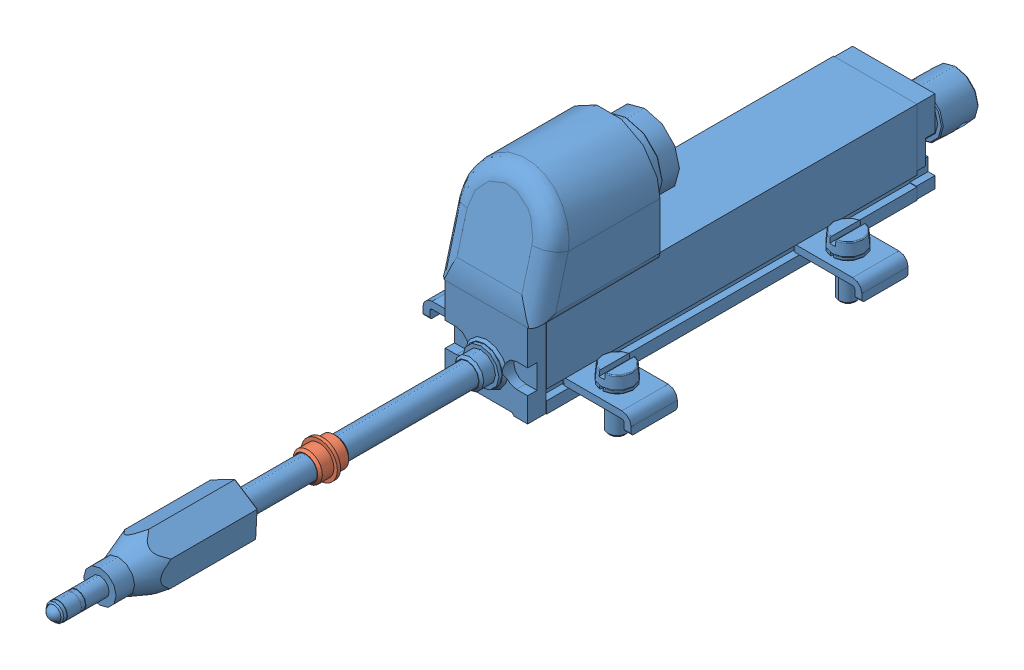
SolidWorks assembly burster_8712-50_63omzyl0r6mvqe9s6coo48p40_Temp.SLDASM, configuration Default (file format 4100). Lengths in mm.
Overall size (45 46.3 196.55).
2 component instances, 2 part files, 0 mates.
Components (placement in the parent):
- burster_8712-50_63omzyl0r6mvqe9s6coo48p40_01-1: burster_8712-50_63omzyl0r6mvqe9s6coo48p40_01.SLDPRT [Default] at origin size (45 46.3 196.55)
- burster_8712-50_63omzyl0r6mvqe9s6coo48p40_02-1: burster_8712-50_63omzyl0r6mvqe9s6coo48p40_02.SLDPRT [Default] at origin size (7.8 7.8 6.7)
